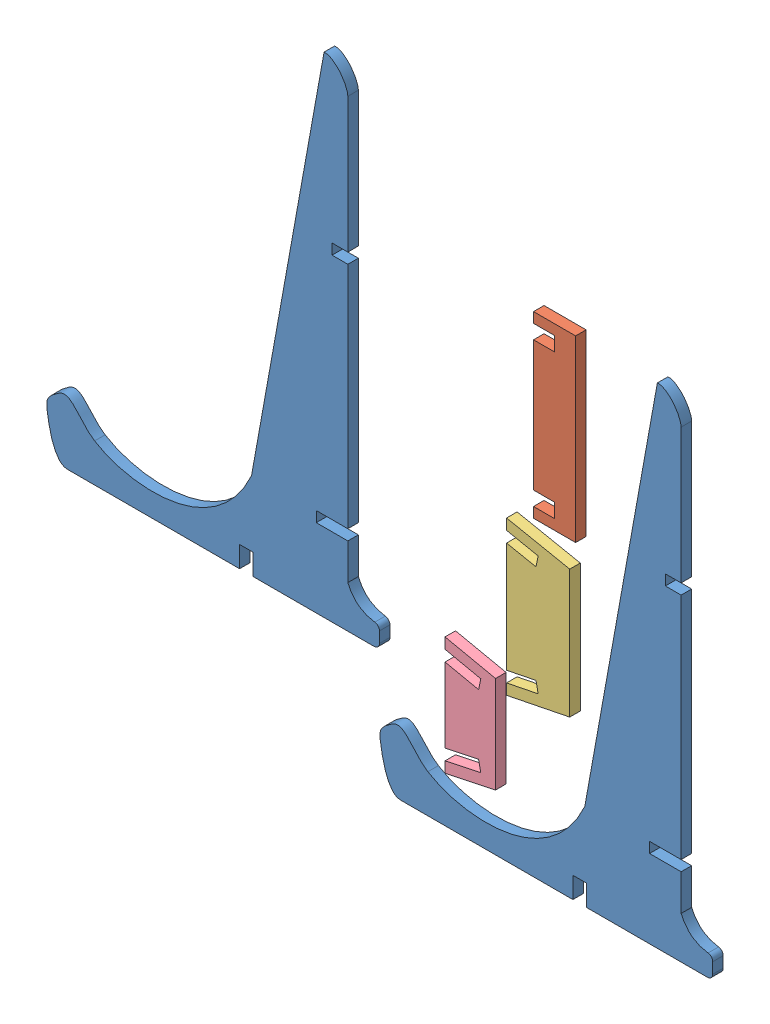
SolidWorks assembly Assemblage1.sldasm, configuration Défaut (file format 10000). Lengths in mm.
Overall size (633.05 579.52 10).
5 component instances, 4 part files, 4 mates.
Components (placement in the parent):
- montant-1: montant.SLDPRT [Défaut] at (186.0694 -218.8087 465.6848) size (316.52 465.68 10)
- ecarteur-1: ecarteur.SLDPRT [Défaut] at (15.864 76.1279 465.6848) size (40 170 10)
- montant-2: montant.SLDPRT [Défaut] at (-130.4542 -104.9745 465.6848) size (316.52 465.68 10)
- plateau_bas-1: plateau_bas.SLDPRT [Défaut] at (50.2709 -84.3558 465.6848) size (60 145.85 10)
- plateau_haut-1: plateau_haut.SLDPRT [Défaut] at (-20.1802 -184.5465 465.6848) size (48 112.17 10)
Mates (geometry in assembly coordinates):
- Coïncidente2: coincident aligned: plane of montant-1 through (148.1863 237.8949 475.6848) normal (0 0 1); plane of ecarteur-1 through (15.864 76.1279 475.6848) normal (0 0 1)
- Coïncidente3: coincident aligned: plane of montant-1 through (148.1863 237.8949 475.6848) normal (0 0 1); plane of plateau_haut-1 through (-20.1802 -184.5465 475.6848) normal (0 0 1)
- Coïncidente4: coincident aligned: plane of montant-1 through (148.1863 237.8949 475.6848) normal (0 0 1); plane of plateau_bas-1 through (50.2709 -84.3558 475.6848) normal (0 0 1)
- Coïncidente5: coincident aligned: plane of montant-1 through (148.1863 237.8949 475.6848) normal (0 0 1); plane of montant-2 through (-168.3373 351.729 475.6848) normal (0 0 1)
